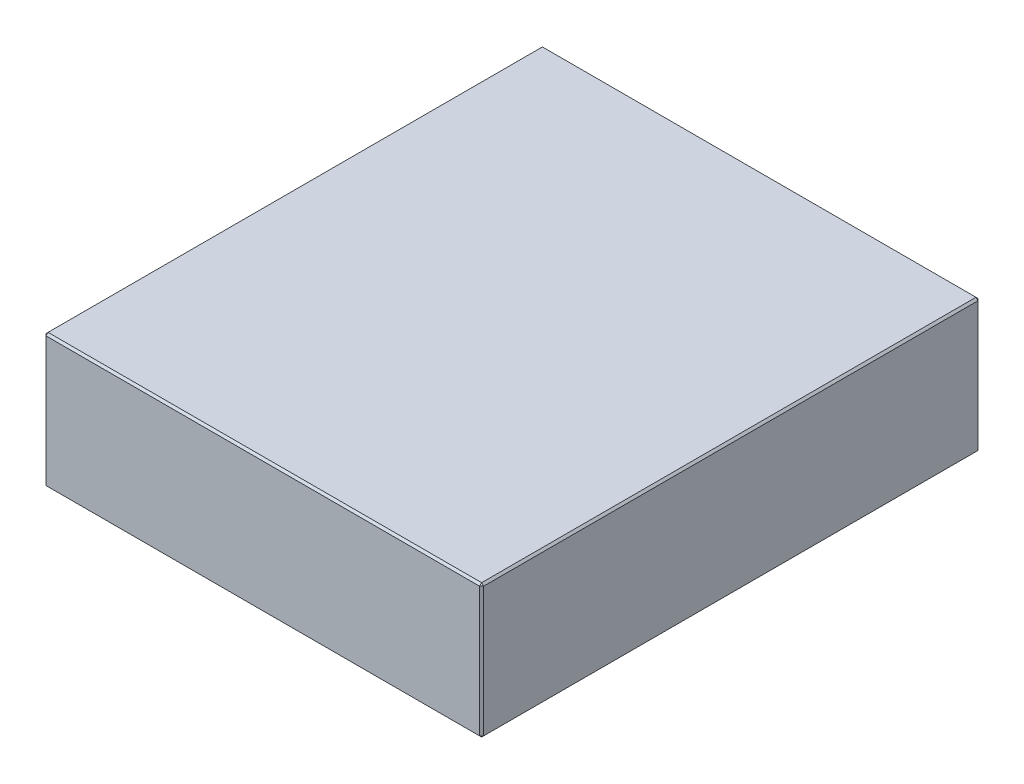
ISO-10303-21;
HEADER;
FILE_DESCRIPTION(('STEP AP214'),'2;1');
FILE_NAME('part.step','',(''),(''),'','','');
FILE_SCHEMA(('AUTOMOTIVE_DESIGN { 1 0 10303 214 1 1 1 1 }'));
ENDSEC;
DATA;
#1=APPLICATION_CONTEXT('core data for automotive mechanical design processes');
#2=APPLICATION_PROTOCOL_DEFINITION('international standard','automotive_design',2000,#1);
#3=PRODUCT_CONTEXT('',#1,'mechanical');
#4=PRODUCT('Part','Part','',(#3));
#5=PRODUCT_RELATED_PRODUCT_CATEGORY('part','',(#4));
#6=PRODUCT_DEFINITION_FORMATION('','',#4);
#7=PRODUCT_DEFINITION_CONTEXT('part definition',#1,'design');
#8=PRODUCT_DEFINITION('design','',#6,#7);
#9=PRODUCT_DEFINITION_SHAPE('','',#8);
#10=(LENGTH_UNIT() NAMED_UNIT(*) SI_UNIT(.MILLI.,.METRE.));
#11=(NAMED_UNIT(*) PLANE_ANGLE_UNIT() SI_UNIT($,.RADIAN.));
#12=(NAMED_UNIT(*) SI_UNIT($,.STERADIAN.) SOLID_ANGLE_UNIT());
#13=UNCERTAINTY_MEASURE_WITH_UNIT(LENGTH_MEASURE(1.E-05),#10,'distance_accuracy_value','');
#14=(GEOMETRIC_REPRESENTATION_CONTEXT(3) GLOBAL_UNCERTAINTY_ASSIGNED_CONTEXT((#13)) GLOBAL_UNIT_ASSIGNED_CONTEXT((#10,
#11,#12)) REPRESENTATION_CONTEXT('',''));
#15=CARTESIAN_POINT('',(0.,0.,0.));
#16=DIRECTION('',(0.,0.,1.));
#17=DIRECTION('',(1.,0.,0.));
#18=AXIS2_PLACEMENT_3D('',#15,#16,#17);
#19=CARTESIAN_POINT('',(-108.,66.,123.));
#20=DIRECTION('',(1.,0.,0.));
#21=DIRECTION('',(0.,0.,-1.));
#22=AXIS2_PLACEMENT_3D('',#19,#20,#21);
#23=PLANE('',#22);
#24=DIRECTION('',(0.,-1.,0.));
#25=VECTOR('',#24,1.);
#26=CARTESIAN_POINT('',(-108.,66.,-122.));
#27=LINE('',#26,#25);
#28=CARTESIAN_POINT('',(-108.,65.,-122.));
#29=VERTEX_POINT('',#28);
#30=CARTESIAN_POINT('',(-108.,1.,-122.));
#31=VERTEX_POINT('',#30);
#32=EDGE_CURVE('E115',#29,#31,#27,.T.);
#33=ORIENTED_EDGE('',*,*,#32,.T.);
#34=DIRECTION('',(0.,0.,1.));
#35=VECTOR('',#34,1.);
#36=CARTESIAN_POINT('',(-108.,1.,123.));
#37=LINE('',#36,#35);
#38=CARTESIAN_POINT('',(-108.,1.,122.));
#39=VERTEX_POINT('',#38);
#40=EDGE_CURVE('E111',#31,#39,#37,.T.);
#41=ORIENTED_EDGE('',*,*,#40,.T.);
#42=DIRECTION('',(0.,1.,0.));
#43=VECTOR('',#42,1.);
#44=CARTESIAN_POINT('',(-108.,66.,122.));
#45=LINE('',#44,#43);
#46=CARTESIAN_POINT('',(-108.,65.,122.));
#47=VERTEX_POINT('',#46);
#48=EDGE_CURVE('E104',#39,#47,#45,.T.);
#49=ORIENTED_EDGE('',*,*,#48,.T.);
#50=DIRECTION('',(0.,0.,-1.));
#51=VECTOR('',#50,1.);
#52=CARTESIAN_POINT('',(-108.,65.,-123.));
#53=LINE('',#52,#51);
#54=EDGE_CURVE('E108',#47,#29,#53,.T.);
#55=ORIENTED_EDGE('',*,*,#54,.T.);
#56=EDGE_LOOP('',(#33,#41,#49,#55));
#57=FACE_BOUND('',#56,.T.);
#58=ADVANCED_FACE('F16',(#57),#23,.F.);
#59=CARTESIAN_POINT('',(108.,66.,123.));
#60=DIRECTION('',(0.,0.,-1.));
#61=DIRECTION('',(-1.,0.,0.));
#62=AXIS2_PLACEMENT_3D('',#59,#60,#61);
#63=PLANE('',#62);
#64=DIRECTION('',(-1.,0.,0.));
#65=VECTOR('',#64,1.);
#66=CARTESIAN_POINT('',(-108.,65.,123.));
#67=LINE('',#66,#65);
#68=CARTESIAN_POINT('',(107.,65.,123.));
#69=VERTEX_POINT('',#68);
#70=CARTESIAN_POINT('',(-107.,65.,123.));
#71=VERTEX_POINT('',#70);
#72=EDGE_CURVE('E165',#69,#71,#67,.T.);
#73=ORIENTED_EDGE('',*,*,#72,.T.);
#74=DIRECTION('',(0.,-1.,0.));
#75=VECTOR('',#74,1.);
#76=CARTESIAN_POINT('',(-107.,66.,123.));
#77=LINE('',#76,#75);
#78=CARTESIAN_POINT('',(-107.,1.,123.));
#79=VERTEX_POINT('',#78);
#80=EDGE_CURVE('E123',#71,#79,#77,.T.);
#81=ORIENTED_EDGE('',*,*,#80,.T.);
#82=DIRECTION('',(1.,0.,0.));
#83=VECTOR('',#82,1.);
#84=CARTESIAN_POINT('',(108.,1.,123.));
#85=LINE('',#84,#83);
#86=CARTESIAN_POINT('',(107.,1.,123.));
#87=VERTEX_POINT('',#86);
#88=EDGE_CURVE('E169',#79,#87,#85,.T.);
#89=ORIENTED_EDGE('',*,*,#88,.T.);
#90=DIRECTION('',(0.,1.,0.));
#91=VECTOR('',#90,1.);
#92=CARTESIAN_POINT('',(107.,66.,123.));
#93=LINE('',#92,#91);
#94=EDGE_CURVE('E167',#87,#69,#93,.T.);
#95=ORIENTED_EDGE('',*,*,#94,.T.);
#96=EDGE_LOOP('',(#73,#81,#89,#95));
#97=FACE_BOUND('',#96,.T.);
#98=ADVANCED_FACE('F276',(#97),#63,.F.);
#99=CARTESIAN_POINT('',(108.,66.,123.));
#100=DIRECTION('',(-1.,0.,0.));
#101=DIRECTION('',(0.,0.,1.));
#102=AXIS2_PLACEMENT_3D('',#99,#100,#101);
#103=PLANE('',#102);
#104=DIRECTION('',(0.,0.,-1.));
#105=VECTOR('',#104,1.);
#106=CARTESIAN_POINT('',(108.,1.,123.));
#107=LINE('',#106,#105);
#108=CARTESIAN_POINT('',(108.,1.,122.));
#109=VERTEX_POINT('',#108);
#110=CARTESIAN_POINT('',(108.,1.,-122.));
#111=VERTEX_POINT('',#110);
#112=EDGE_CURVE('E160',#109,#111,#107,.T.);
#113=ORIENTED_EDGE('',*,*,#112,.T.);
#114=DIRECTION('',(0.,1.,0.));
#115=VECTOR('',#114,1.);
#116=CARTESIAN_POINT('',(108.,66.,-122.));
#117=LINE('',#116,#115);
#118=CARTESIAN_POINT('',(108.,65.,-122.));
#119=VERTEX_POINT('',#118);
#120=EDGE_CURVE('E162',#111,#119,#117,.T.);
#121=ORIENTED_EDGE('',*,*,#120,.T.);
#122=DIRECTION('',(0.,0.,1.));
#123=VECTOR('',#122,1.);
#124=CARTESIAN_POINT('',(108.,65.,123.));
#125=LINE('',#124,#123);
#126=CARTESIAN_POINT('',(108.,65.,122.));
#127=VERTEX_POINT('',#126);
#128=EDGE_CURVE('E156',#119,#127,#125,.T.);
#129=ORIENTED_EDGE('',*,*,#128,.T.);
#130=DIRECTION('',(0.,-1.,0.));
#131=VECTOR('',#130,1.);
#132=CARTESIAN_POINT('',(108.,66.,122.));
#133=LINE('',#132,#131);
#134=EDGE_CURVE('E158',#127,#109,#133,.T.);
#135=ORIENTED_EDGE('',*,*,#134,.T.);
#136=EDGE_LOOP('',(#113,#121,#129,#135));
#137=FACE_BOUND('',#136,.T.);
#138=ADVANCED_FACE('F255',(#137),#103,.F.);
#139=CARTESIAN_POINT('',(108.,66.,-123.));
#140=DIRECTION('',(0.,0.,1.));
#141=DIRECTION('',(1.,0.,0.));
#142=AXIS2_PLACEMENT_3D('',#139,#140,#141);
#143=PLANE('',#142);
#144=DIRECTION('',(0.,-1.,0.));
#145=VECTOR('',#144,1.);
#146=CARTESIAN_POINT('',(107.,66.,-123.));
#147=LINE('',#146,#145);
#148=CARTESIAN_POINT('',(107.,65.,-123.));
#149=VERTEX_POINT('',#148);
#150=CARTESIAN_POINT('',(107.,1.,-123.));
#151=VERTEX_POINT('',#150);
#152=EDGE_CURVE('E149',#149,#151,#147,.T.);
#153=ORIENTED_EDGE('',*,*,#152,.T.);
#154=DIRECTION('',(-1.,0.,0.));
#155=VECTOR('',#154,1.);
#156=CARTESIAN_POINT('',(108.,1.,-123.));
#157=LINE('',#156,#155);
#158=CARTESIAN_POINT('',(-107.,1.,-123.));
#159=VERTEX_POINT('',#158);
#160=EDGE_CURVE('E154',#151,#159,#157,.T.);
#161=ORIENTED_EDGE('',*,*,#160,.T.);
#162=DIRECTION('',(0.,1.,0.));
#163=VECTOR('',#162,1.);
#164=CARTESIAN_POINT('',(-107.,66.,-123.));
#165=LINE('',#164,#163);
#166=CARTESIAN_POINT('',(-107.,65.,-123.));
#167=VERTEX_POINT('',#166);
#168=EDGE_CURVE('E151',#159,#167,#165,.T.);
#169=ORIENTED_EDGE('',*,*,#168,.T.);
#170=DIRECTION('',(1.,0.,0.));
#171=VECTOR('',#170,1.);
#172=CARTESIAN_POINT('',(108.,65.,-123.));
#173=LINE('',#172,#171);
#174=EDGE_CURVE('E147',#167,#149,#173,.T.);
#175=ORIENTED_EDGE('',*,*,#174,.T.);
#176=EDGE_LOOP('',(#153,#161,#169,#175));
#177=FACE_BOUND('',#176,.T.);
#178=ADVANCED_FACE('F285',(#177),#143,.F.);
#179=CARTESIAN_POINT('',(0.,66.,0.));
#180=DIRECTION('',(0.,1.,0.));
#181=DIRECTION('',(0.,0.,1.));
#182=AXIS2_PLACEMENT_3D('',#179,#180,#181);
#183=PLANE('',#182);
#184=DIRECTION('',(0.,0.,-1.));
#185=VECTOR('',#184,1.);
#186=CARTESIAN_POINT('',(107.,66.,-123.));
#187=LINE('',#186,#185);
#188=CARTESIAN_POINT('',(107.,66.,122.));
#189=VERTEX_POINT('',#188);
#190=CARTESIAN_POINT('',(107.,66.,-122.));
#191=VERTEX_POINT('',#190);
#192=EDGE_CURVE('E25',#189,#191,#187,.T.);
#193=ORIENTED_EDGE('',*,*,#192,.T.);
#194=DIRECTION('',(-1.,0.,0.));
#195=VECTOR('',#194,1.);
#196=CARTESIAN_POINT('',(-108.,66.,-122.));
#197=LINE('',#196,#195);
#198=CARTESIAN_POINT('',(-107.,66.,-122.));
#199=VERTEX_POINT('',#198);
#200=EDGE_CURVE('E10',#191,#199,#197,.T.);
#201=ORIENTED_EDGE('',*,*,#200,.T.);
#202=DIRECTION('',(0.,0.,1.));
#203=VECTOR('',#202,1.);
#204=CARTESIAN_POINT('',(-107.,66.,123.));
#205=LINE('',#204,#203);
#206=CARTESIAN_POINT('',(-107.,66.,122.));
#207=VERTEX_POINT('',#206);
#208=EDGE_CURVE('E181',#199,#207,#205,.T.);
#209=ORIENTED_EDGE('',*,*,#208,.T.);
#210=DIRECTION('',(1.,0.,0.));
#211=VECTOR('',#210,1.);
#212=CARTESIAN_POINT('',(108.,66.,122.));
#213=LINE('',#212,#211);
#214=EDGE_CURVE('E36',#207,#189,#213,.T.);
#215=ORIENTED_EDGE('',*,*,#214,.T.);
#216=EDGE_LOOP('',(#193,#201,#209,#215));
#217=FACE_BOUND('',#216,.T.);
#218=ADVANCED_FACE('F351',(#217),#183,.T.);
#219=CARTESIAN_POINT('',(0.,0.,0.));
#220=DIRECTION('',(0.,1.,0.));
#221=DIRECTION('',(0.,0.,1.));
#222=AXIS2_PLACEMENT_3D('',#219,#220,#221);
#223=PLANE('',#222);
#224=DIRECTION('',(0.,0.,1.));
#225=VECTOR('',#224,1.);
#226=CARTESIAN_POINT('',(107.,0.,0.));
#227=LINE('',#226,#225);
#228=CARTESIAN_POINT('',(107.,0.,-122.));
#229=VERTEX_POINT('',#228);
#230=CARTESIAN_POINT('',(107.,0.,122.));
#231=VERTEX_POINT('',#230);
#232=EDGE_CURVE('E172',#229,#231,#227,.T.);
#233=ORIENTED_EDGE('',*,*,#232,.T.);
#234=DIRECTION('',(-1.,0.,0.));
#235=VECTOR('',#234,1.);
#236=CARTESIAN_POINT('',(0.,0.,122.));
#237=LINE('',#236,#235);
#238=CARTESIAN_POINT('',(-107.,0.,122.));
#239=VERTEX_POINT('',#238);
#240=EDGE_CURVE('E178',#231,#239,#237,.T.);
#241=ORIENTED_EDGE('',*,*,#240,.T.);
#242=DIRECTION('',(0.,0.,-1.));
#243=VECTOR('',#242,1.);
#244=CARTESIAN_POINT('',(-107.,0.,0.));
#245=LINE('',#244,#243);
#246=CARTESIAN_POINT('',(-107.,0.,-122.));
#247=VERTEX_POINT('',#246);
#248=EDGE_CURVE('E176',#239,#247,#245,.T.);
#249=ORIENTED_EDGE('',*,*,#248,.T.);
#250=DIRECTION('',(1.,0.,0.));
#251=VECTOR('',#250,1.);
#252=CARTESIAN_POINT('',(0.,0.,-122.));
#253=LINE('',#252,#251);
#254=EDGE_CURVE('E174',#247,#229,#253,.T.);
#255=ORIENTED_EDGE('',*,*,#254,.T.);
#256=EDGE_LOOP('',(#233,#241,#249,#255));
#257=FACE_BOUND('',#256,.T.);
#258=ADVANCED_FACE('F247',(#257),#223,.F.);
#259=CARTESIAN_POINT('',(108.,66.,122.));
#260=DIRECTION('',(-0.707106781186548,0.,-0.707106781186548));
#261=DIRECTION('',(0.,-1.,0.));
#262=AXIS2_PLACEMENT_3D('',#259,#260,#261);
#263=PLANE('',#262);
#264=DIRECTION('',(-0.707106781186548,0.,0.707106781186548));
#265=VECTOR('',#264,1.);
#266=CARTESIAN_POINT('',(107.,65.,123.));
#267=LINE('',#266,#265);
#268=EDGE_CURVE('E20',#69,#127,#267,.F.);
#269=ORIENTED_EDGE('',*,*,#268,.F.);
#270=ORIENTED_EDGE('',*,*,#94,.F.);
#271=DIRECTION('',(0.707106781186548,0.,-0.707106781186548));
#272=VECTOR('',#271,1.);
#273=CARTESIAN_POINT('',(107.,1.,123.));
#274=LINE('',#273,#272);
#275=EDGE_CURVE('E143',#109,#87,#274,.F.);
#276=ORIENTED_EDGE('',*,*,#275,.F.);
#277=ORIENTED_EDGE('',*,*,#134,.F.);
#278=EDGE_LOOP('',(#269,#270,#276,#277));
#279=FACE_BOUND('',#278,.T.);
#280=ADVANCED_FACE('F18',(#279),#263,.F.);
#281=CARTESIAN_POINT('',(107.,65.,123.));
#282=DIRECTION('',(0.577350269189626,0.577350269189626,0.577350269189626));
#283=DIRECTION('',(0.707106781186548,0.,-0.707106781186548));
#284=AXIS2_PLACEMENT_3D('',#281,#282,#283);
#285=PLANE('',#284);
#286=DIRECTION('',(0.,-0.707106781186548,0.707106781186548));
#287=VECTOR('',#286,1.);
#288=CARTESIAN_POINT('',(107.,65.,123.));
#289=LINE('',#288,#287);
#290=EDGE_CURVE('E227',#69,#189,#289,.F.);
#291=ORIENTED_EDGE('',*,*,#290,.F.);
#292=ORIENTED_EDGE('',*,*,#268,.T.);
#293=DIRECTION('',(-0.707106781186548,0.707106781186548,0.));
#294=VECTOR('',#293,1.);
#295=CARTESIAN_POINT('',(107.5,65.5,122.));
#296=LINE('',#295,#294);
#297=EDGE_CURVE('E229',#189,#127,#296,.F.);
#298=ORIENTED_EDGE('',*,*,#297,.F.);
#299=EDGE_LOOP('',(#291,#292,#298));
#300=FACE_BOUND('',#299,.T.);
#301=ADVANCED_FACE('F271',(#300),#285,.T.);
#302=CARTESIAN_POINT('',(107.,1.,123.));
#303=DIRECTION('',(0.577350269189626,-0.577350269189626,0.577350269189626));
#304=DIRECTION('',(0.707106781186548,0.,-0.707106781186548));
#305=AXIS2_PLACEMENT_3D('',#302,#303,#304);
#306=PLANE('',#305);
#307=DIRECTION('',(-0.707106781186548,-0.707106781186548,0.));
#308=VECTOR('',#307,1.);
#309=CARTESIAN_POINT('',(107.5,0.5,122.));
#310=LINE('',#309,#308);
#311=EDGE_CURVE('E221',#109,#231,#310,.T.);
#312=ORIENTED_EDGE('',*,*,#311,.F.);
#313=ORIENTED_EDGE('',*,*,#275,.T.);
#314=DIRECTION('',(0.,0.707106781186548,0.707106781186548));
#315=VECTOR('',#314,1.);
#316=CARTESIAN_POINT('',(107.,1.,123.));
#317=LINE('',#316,#315);
#318=EDGE_CURVE('E224',#231,#87,#317,.T.);
#319=ORIENTED_EDGE('',*,*,#318,.F.);
#320=EDGE_LOOP('',(#312,#313,#319));
#321=FACE_BOUND('',#320,.T.);
#322=ADVANCED_FACE('F236',(#321),#306,.T.);
#323=CARTESIAN_POINT('',(107.,66.,0.));
#324=DIRECTION('',(0.707106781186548,0.707106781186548,0.));
#325=DIRECTION('',(0.,0.,1.));
#326=AXIS2_PLACEMENT_3D('',#323,#324,#325);
#327=PLANE('',#326);
#328=ORIENTED_EDGE('',*,*,#297,.T.);
#329=ORIENTED_EDGE('',*,*,#128,.F.);
#330=DIRECTION('',(0.707106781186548,-0.707106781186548,0.));
#331=VECTOR('',#330,1.);
#332=CARTESIAN_POINT('',(108.,65.,-122.));
#333=LINE('',#332,#331);
#334=EDGE_CURVE('E216',#191,#119,#333,.T.);
#335=ORIENTED_EDGE('',*,*,#334,.F.);
#336=ORIENTED_EDGE('',*,*,#192,.F.);
#337=EDGE_LOOP('',(#328,#329,#335,#336));
#338=FACE_BOUND('',#337,.T.);
#339=ADVANCED_FACE('F266',(#338),#327,.T.);
#340=CARTESIAN_POINT('',(0.,66.,122.));
#341=DIRECTION('',(0.,0.707106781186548,0.707106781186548));
#342=DIRECTION('',(-1.,0.,0.));
#343=AXIS2_PLACEMENT_3D('',#340,#341,#342);
#344=PLANE('',#343);
#345=ORIENTED_EDGE('',*,*,#290,.T.);
#346=ORIENTED_EDGE('',*,*,#214,.F.);
#347=DIRECTION('',(0.,0.707106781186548,-0.707106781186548));
#348=VECTOR('',#347,1.);
#349=CARTESIAN_POINT('',(-107.,65.5,122.5));
#350=LINE('',#349,#348);
#351=EDGE_CURVE('E127',#71,#207,#350,.T.);
#352=ORIENTED_EDGE('',*,*,#351,.F.);
#353=ORIENTED_EDGE('',*,*,#72,.F.);
#354=EDGE_LOOP('',(#345,#346,#352,#353));
#355=FACE_BOUND('',#354,.T.);
#356=ADVANCED_FACE('F274',(#355),#344,.T.);
#357=CARTESIAN_POINT('',(-107.,66.,123.));
#358=DIRECTION('',(0.707106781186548,0.,-0.707106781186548));
#359=DIRECTION('',(0.,-1.,0.));
#360=AXIS2_PLACEMENT_3D('',#357,#358,#359);
#361=PLANE('',#360);
#362=DIRECTION('',(0.707106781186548,0.,0.707106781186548));
#363=VECTOR('',#362,1.);
#364=CARTESIAN_POINT('',(-107.,1.,123.));
#365=LINE('',#364,#363);
#366=EDGE_CURVE('E128',#79,#39,#365,.F.);
#367=ORIENTED_EDGE('',*,*,#366,.F.);
#368=ORIENTED_EDGE('',*,*,#80,.F.);
#369=DIRECTION('',(-0.707106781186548,0.,-0.707106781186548));
#370=VECTOR('',#369,1.);
#371=CARTESIAN_POINT('',(-108.,65.,122.));
#372=LINE('',#371,#370);
#373=EDGE_CURVE('E119',#47,#71,#372,.F.);
#374=ORIENTED_EDGE('',*,*,#373,.F.);
#375=ORIENTED_EDGE('',*,*,#48,.F.);
#376=EDGE_LOOP('',(#367,#368,#374,#375));
#377=FACE_BOUND('',#376,.T.);
#378=ADVANCED_FACE('F121',(#377),#361,.F.);
#379=CARTESIAN_POINT('',(108.,1.,123.));
#380=DIRECTION('',(0.,0.707106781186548,-0.707106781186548));
#381=DIRECTION('',(1.,0.,0.));
#382=AXIS2_PLACEMENT_3D('',#379,#380,#381);
#383=PLANE('',#382);
#384=ORIENTED_EDGE('',*,*,#318,.T.);
#385=ORIENTED_EDGE('',*,*,#88,.F.);
#386=DIRECTION('',(0.,-0.707106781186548,-0.707106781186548));
#387=VECTOR('',#386,1.);
#388=CARTESIAN_POINT('',(-107.,1.,123.));
#389=LINE('',#388,#387);
#390=EDGE_CURVE('E212',#239,#79,#389,.F.);
#391=ORIENTED_EDGE('',*,*,#390,.F.);
#392=ORIENTED_EDGE('',*,*,#240,.F.);
#393=EDGE_LOOP('',(#384,#385,#391,#392));
#394=FACE_BOUND('',#393,.T.);
#395=ADVANCED_FACE('F244',(#394),#383,.F.);
#396=CARTESIAN_POINT('',(108.,1.,123.));
#397=DIRECTION('',(-0.707106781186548,0.707106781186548,0.));
#398=DIRECTION('',(0.,0.,-1.));
#399=AXIS2_PLACEMENT_3D('',#396,#397,#398);
#400=PLANE('',#399);
#401=ORIENTED_EDGE('',*,*,#311,.T.);
#402=ORIENTED_EDGE('',*,*,#232,.F.);
#403=DIRECTION('',(0.707106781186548,0.707106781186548,0.));
#404=VECTOR('',#403,1.);
#405=CARTESIAN_POINT('',(107.5,0.5,-122.));
#406=LINE('',#405,#404);
#407=EDGE_CURVE('E209',#111,#229,#406,.F.);
#408=ORIENTED_EDGE('',*,*,#407,.F.);
#409=ORIENTED_EDGE('',*,*,#112,.F.);
#410=EDGE_LOOP('',(#401,#402,#408,#409));
#411=FACE_BOUND('',#410,.T.);
#412=ADVANCED_FACE('F252',(#411),#400,.F.);
#413=CARTESIAN_POINT('',(107.,66.,-123.));
#414=DIRECTION('',(-0.707106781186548,0.,0.707106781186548));
#415=DIRECTION('',(0.,-1.,0.));
#416=AXIS2_PLACEMENT_3D('',#413,#414,#415);
#417=PLANE('',#416);
#418=DIRECTION('',(0.707106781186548,0.,0.707106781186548));
#419=VECTOR('',#418,1.);
#420=CARTESIAN_POINT('',(108.,65.,-122.));
#421=LINE('',#420,#419);
#422=EDGE_CURVE('E218',#119,#149,#421,.F.);
#423=ORIENTED_EDGE('',*,*,#422,.F.);
#424=ORIENTED_EDGE('',*,*,#120,.F.);
#425=DIRECTION('',(-0.707106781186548,0.,-0.707106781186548));
#426=VECTOR('',#425,1.);
#427=CARTESIAN_POINT('',(107.,1.,-123.));
#428=LINE('',#427,#426);
#429=EDGE_CURVE('E206',#151,#111,#428,.F.);
#430=ORIENTED_EDGE('',*,*,#429,.F.);
#431=ORIENTED_EDGE('',*,*,#152,.F.);
#432=EDGE_LOOP('',(#423,#424,#430,#431));
#433=FACE_BOUND('',#432,.T.);
#434=ADVANCED_FACE('F259',(#433),#417,.F.);
#435=CARTESIAN_POINT('',(108.,65.,-122.));
#436=DIRECTION('',(0.577350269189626,0.577350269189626,-0.577350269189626));
#437=DIRECTION('',(-0.707106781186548,0.,-0.707106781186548));
#438=AXIS2_PLACEMENT_3D('',#435,#436,#437);
#439=PLANE('',#438);
#440=ORIENTED_EDGE('',*,*,#334,.T.);
#441=ORIENTED_EDGE('',*,*,#422,.T.);
#442=DIRECTION('',(0.,0.707106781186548,0.707106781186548));
#443=VECTOR('',#442,1.);
#444=CARTESIAN_POINT('',(107.,65.5,-122.5));
#445=LINE('',#444,#443);
#446=EDGE_CURVE('E135',#191,#149,#445,.F.);
#447=ORIENTED_EDGE('',*,*,#446,.F.);
#448=EDGE_LOOP('',(#440,#441,#447));
#449=FACE_BOUND('',#448,.T.);
#450=ADVANCED_FACE('F326',(#449),#439,.T.);
#451=CARTESIAN_POINT('',(-108.,65.,122.));
#452=DIRECTION('',(-0.577350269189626,0.577350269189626,0.577350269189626));
#453=DIRECTION('',(0.707106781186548,0.,0.707106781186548));
#454=AXIS2_PLACEMENT_3D('',#451,#452,#453);
#455=PLANE('',#454);
#456=ORIENTED_EDGE('',*,*,#373,.T.);
#457=ORIENTED_EDGE('',*,*,#351,.T.);
#458=DIRECTION('',(-0.707106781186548,-0.707106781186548,0.));
#459=VECTOR('',#458,1.);
#460=CARTESIAN_POINT('',(-108.,65.,122.));
#461=LINE('',#460,#459);
#462=EDGE_CURVE('E131',#47,#207,#461,.F.);
#463=ORIENTED_EDGE('',*,*,#462,.F.);
#464=EDGE_LOOP('',(#456,#457,#463));
#465=FACE_BOUND('',#464,.T.);
#466=ADVANCED_FACE('F132',(#465),#455,.T.);
#467=CARTESIAN_POINT('',(-107.,1.,123.));
#468=DIRECTION('',(-0.577350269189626,-0.577350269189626,0.577350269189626));
#469=DIRECTION('',(0.707106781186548,0.,0.707106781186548));
#470=AXIS2_PLACEMENT_3D('',#467,#468,#469);
#471=PLANE('',#470);
#472=ORIENTED_EDGE('',*,*,#390,.T.);
#473=ORIENTED_EDGE('',*,*,#366,.T.);
#474=DIRECTION('',(-0.707106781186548,0.707106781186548,0.));
#475=VECTOR('',#474,1.);
#476=CARTESIAN_POINT('',(-107.5,0.5,122.));
#477=LINE('',#476,#475);
#478=EDGE_CURVE('E136',#239,#39,#477,.T.);
#479=ORIENTED_EDGE('',*,*,#478,.F.);
#480=EDGE_LOOP('',(#472,#473,#479));
#481=FACE_BOUND('',#480,.T.);
#482=ADVANCED_FACE('F319',(#481),#471,.T.);
#483=CARTESIAN_POINT('',(107.,1.,-123.));
#484=DIRECTION('',(0.577350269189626,-0.577350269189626,-0.577350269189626));
#485=DIRECTION('',(-0.707106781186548,0.,-0.707106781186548));
#486=AXIS2_PLACEMENT_3D('',#483,#484,#485);
#487=PLANE('',#486);
#488=ORIENTED_EDGE('',*,*,#429,.T.);
#489=ORIENTED_EDGE('',*,*,#407,.T.);
#490=DIRECTION('',(0.,-0.707106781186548,0.707106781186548));
#491=VECTOR('',#490,1.);
#492=CARTESIAN_POINT('',(107.,1.,-123.));
#493=LINE('',#492,#491);
#494=EDGE_CURVE('E199',#151,#229,#493,.T.);
#495=ORIENTED_EDGE('',*,*,#494,.F.);
#496=EDGE_LOOP('',(#488,#489,#495));
#497=FACE_BOUND('',#496,.T.);
#498=ADVANCED_FACE('F315',(#497),#487,.T.);
#499=CARTESIAN_POINT('',(0.,66.,-122.));
#500=DIRECTION('',(0.,0.707106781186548,-0.707106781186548));
#501=DIRECTION('',(1.,0.,0.));
#502=AXIS2_PLACEMENT_3D('',#499,#500,#501);
#503=PLANE('',#502);
#504=ORIENTED_EDGE('',*,*,#446,.T.);
#505=ORIENTED_EDGE('',*,*,#174,.F.);
#506=DIRECTION('',(0.,-0.707106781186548,-0.707106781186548));
#507=VECTOR('',#506,1.);
#508=CARTESIAN_POINT('',(-107.,65.,-123.));
#509=LINE('',#508,#507);
#510=EDGE_CURVE('E196',#199,#167,#509,.T.);
#511=ORIENTED_EDGE('',*,*,#510,.F.);
#512=ORIENTED_EDGE('',*,*,#200,.F.);
#513=EDGE_LOOP('',(#504,#505,#511,#512));
#514=FACE_BOUND('',#513,.T.);
#515=ADVANCED_FACE('F312',(#514),#503,.T.);
#516=CARTESIAN_POINT('',(-107.,66.,0.));
#517=DIRECTION('',(-0.707106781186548,0.707106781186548,0.));
#518=DIRECTION('',(0.,0.,-1.));
#519=AXIS2_PLACEMENT_3D('',#516,#517,#518);
#520=PLANE('',#519);
#521=ORIENTED_EDGE('',*,*,#462,.T.);
#522=ORIENTED_EDGE('',*,*,#208,.F.);
#523=DIRECTION('',(0.707106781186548,0.707106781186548,0.));
#524=VECTOR('',#523,1.);
#525=CARTESIAN_POINT('',(-107.5,65.5,-122.));
#526=LINE('',#525,#524);
#527=EDGE_CURVE('E139',#29,#199,#526,.T.);
#528=ORIENTED_EDGE('',*,*,#527,.F.);
#529=ORIENTED_EDGE('',*,*,#54,.F.);
#530=EDGE_LOOP('',(#521,#522,#528,#529));
#531=FACE_BOUND('',#530,.T.);
#532=ADVANCED_FACE('F138',(#531),#520,.T.);
#533=CARTESIAN_POINT('',(-108.,1.,123.));
#534=DIRECTION('',(0.707106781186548,0.707106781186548,0.));
#535=DIRECTION('',(0.,0.,1.));
#536=AXIS2_PLACEMENT_3D('',#533,#534,#535);
#537=PLANE('',#536);
#538=ORIENTED_EDGE('',*,*,#478,.T.);
#539=ORIENTED_EDGE('',*,*,#40,.F.);
#540=DIRECTION('',(0.707106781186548,-0.707106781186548,0.));
#541=VECTOR('',#540,1.);
#542=CARTESIAN_POINT('',(-108.,1.,-122.));
#543=LINE('',#542,#541);
#544=EDGE_CURVE('E192',#247,#31,#543,.F.);
#545=ORIENTED_EDGE('',*,*,#544,.F.);
#546=ORIENTED_EDGE('',*,*,#248,.F.);
#547=EDGE_LOOP('',(#538,#539,#545,#546));
#548=FACE_BOUND('',#547,.T.);
#549=ADVANCED_FACE('F305',(#548),#537,.F.);
#550=CARTESIAN_POINT('',(108.,1.,-123.));
#551=DIRECTION('',(0.,0.707106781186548,0.707106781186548));
#552=DIRECTION('',(-1.,0.,0.));
#553=AXIS2_PLACEMENT_3D('',#550,#551,#552);
#554=PLANE('',#553);
#555=ORIENTED_EDGE('',*,*,#494,.T.);
#556=ORIENTED_EDGE('',*,*,#254,.F.);
#557=DIRECTION('',(0.,0.707106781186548,-0.707106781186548));
#558=VECTOR('',#557,1.);
#559=CARTESIAN_POINT('',(-107.,0.5,-122.5));
#560=LINE('',#559,#558);
#561=EDGE_CURVE('E189',#159,#247,#560,.F.);
#562=ORIENTED_EDGE('',*,*,#561,.F.);
#563=ORIENTED_EDGE('',*,*,#160,.F.);
#564=EDGE_LOOP('',(#555,#556,#562,#563));
#565=FACE_BOUND('',#564,.T.);
#566=ADVANCED_FACE('F301',(#565),#554,.F.);
#567=CARTESIAN_POINT('',(-107.,65.,-123.));
#568=DIRECTION('',(-0.577350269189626,0.577350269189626,-0.577350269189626));
#569=DIRECTION('',(-0.707106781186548,0.,0.707106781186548));
#570=AXIS2_PLACEMENT_3D('',#567,#568,#569);
#571=PLANE('',#570);
#572=ORIENTED_EDGE('',*,*,#527,.T.);
#573=ORIENTED_EDGE('',*,*,#510,.T.);
#574=DIRECTION('',(0.707106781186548,0.,-0.707106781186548));
#575=VECTOR('',#574,1.);
#576=CARTESIAN_POINT('',(-107.,65.,-123.));
#577=LINE('',#576,#575);
#578=EDGE_CURVE('E187',#29,#167,#577,.T.);
#579=ORIENTED_EDGE('',*,*,#578,.F.);
#580=EDGE_LOOP('',(#572,#573,#579));
#581=FACE_BOUND('',#580,.T.);
#582=ADVANCED_FACE('F297',(#581),#571,.T.);
#583=CARTESIAN_POINT('',(-108.,1.,-122.));
#584=DIRECTION('',(-0.577350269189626,-0.577350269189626,-0.577350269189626));
#585=DIRECTION('',(-0.707106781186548,0.,0.707106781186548));
#586=AXIS2_PLACEMENT_3D('',#583,#584,#585);
#587=PLANE('',#586);
#588=ORIENTED_EDGE('',*,*,#561,.T.);
#589=ORIENTED_EDGE('',*,*,#544,.T.);
#590=DIRECTION('',(-0.707106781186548,0.,0.707106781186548));
#591=VECTOR('',#590,1.);
#592=CARTESIAN_POINT('',(-108.,1.,-122.));
#593=LINE('',#592,#591);
#594=EDGE_CURVE('E185',#159,#31,#593,.T.);
#595=ORIENTED_EDGE('',*,*,#594,.F.);
#596=EDGE_LOOP('',(#588,#589,#595));
#597=FACE_BOUND('',#596,.T.);
#598=ADVANCED_FACE('F293',(#597),#587,.T.);
#599=CARTESIAN_POINT('',(-108.,66.,-122.));
#600=DIRECTION('',(0.707106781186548,0.,0.707106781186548));
#601=DIRECTION('',(0.,-1.,0.));
#602=AXIS2_PLACEMENT_3D('',#599,#600,#601);
#603=PLANE('',#602);
#604=ORIENTED_EDGE('',*,*,#578,.T.);
#605=ORIENTED_EDGE('',*,*,#168,.F.);
#606=ORIENTED_EDGE('',*,*,#594,.T.);
#607=ORIENTED_EDGE('',*,*,#32,.F.);
#608=EDGE_LOOP('',(#604,#605,#606,#607));
#609=FACE_BOUND('',#608,.T.);
#610=ADVANCED_FACE('F290',(#609),#603,.F.);
#611=CLOSED_SHELL('',(#58,#98,#138,#178,#218,#258,#280,#301,#322,#339,#356,#378,#395,#412,#434,
#450,#466,#482,#498,#515,#532,#549,#566,#582,#598,#610));
#612=MANIFOLD_SOLID_BREP('B1',#611);
#613=ADVANCED_BREP_SHAPE_REPRESENTATION('',(#18,#612),#14);
#614=SHAPE_DEFINITION_REPRESENTATION(#9,#613);
ENDSEC;
END-ISO-10303-21;
